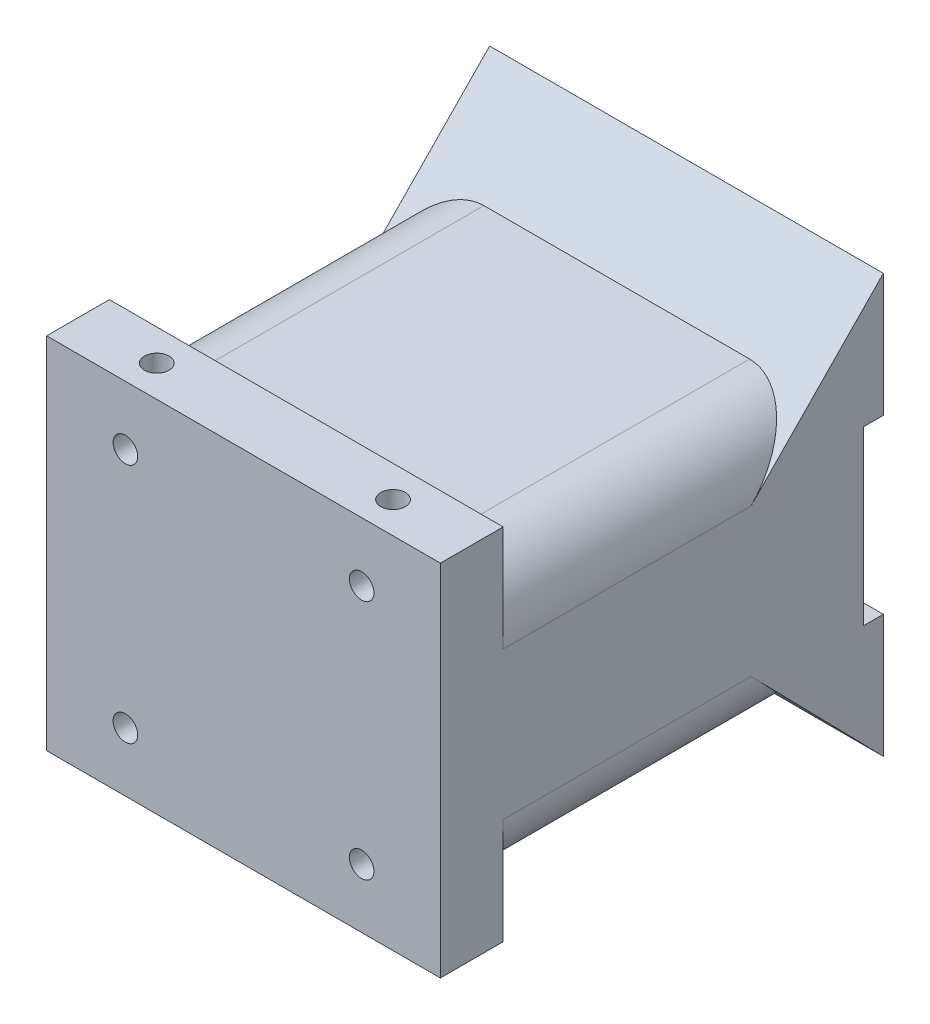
from build123d import *

# Parameters (mm, degrees)
EW_EXTRUDE_DEPTH = 80
CONG_1_R         = 13
ESQUISSE2_R      = 2.5
EXTRUSION2_DEPTH = 5
ESQUISSE1_R      = 2.5
EXTRUSION1_DEPTH = 5


with BuildPart() as part:
    # EW_SKETCH → EW_EXTRUDE (new body)
    with BuildSketch(Plane(origin=(0, 0, 0), x_dir=(0, 0, -1), z_dir=(1, 0, 0))):
        Polygon((-14.166666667, 28), (0, 42.5), (0, 17.5), (-4, 17.5), (-4, -17.5), (0, -17.5), (0, -42.5), (-14.166666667, -28), (-77.25, -28), (-77.25, -36.5), (-90, -36.5), (-90, 36.5), (-77.25, 36.5), (-77.25, 28), align=None)
    extrude(amount=EW_EXTRUDE_DEPTH)

    # Cong_1
    cong_1_edges = [part.edges().sort_by_distance(p)[0] for p in [
        (0, -28, 45.708333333),
        (0, 28, 45.708333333),
        (80, 28, 45.708333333),
        (80, -28, 45.708333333),
    ]]
    fillet(cong_1_edges, radius=CONG_1_R)

    # Esquisse2 → Extrusion2 (cut)
    with BuildSketch(Plane.XY.offset(90)):
        with Locations((16, 24.5)):
            Circle(ESQUISSE2_R)
        with Locations((64, 24.5)):
            Circle(ESQUISSE2_R)
    extrusion2 = extrude(amount=-EXTRUSION2_DEPTH, mode=Mode.SUBTRACT)

    # Esquisse1 → Extrusion1 (cut)
    with BuildSketch(Plane(origin=(0, 36.5, 0), x_dir=(1, 0, 0), z_dir=(0, 1, 0))):
        with Locations(Location((16, -83.625, 0), (0, 0, 270))):
            Circle(ESQUISSE1_R)
        with Locations(Location((64, -83.625, 0), (0, 0, 270))):
            Circle(ESQUISSE1_R)
    extrusion1 = extrude(amount=-EXTRUSION1_DEPTH, mode=Mode.SUBTRACT)

    # Sym_trie1: Extrusion2, Extrusion1 across plane
    add(extrusion2.mirror(Plane.ZX), mode=Mode.SUBTRACT)
    add(extrusion1.mirror(Plane.ZX), mode=Mode.SUBTRACT)


solid = part.part
